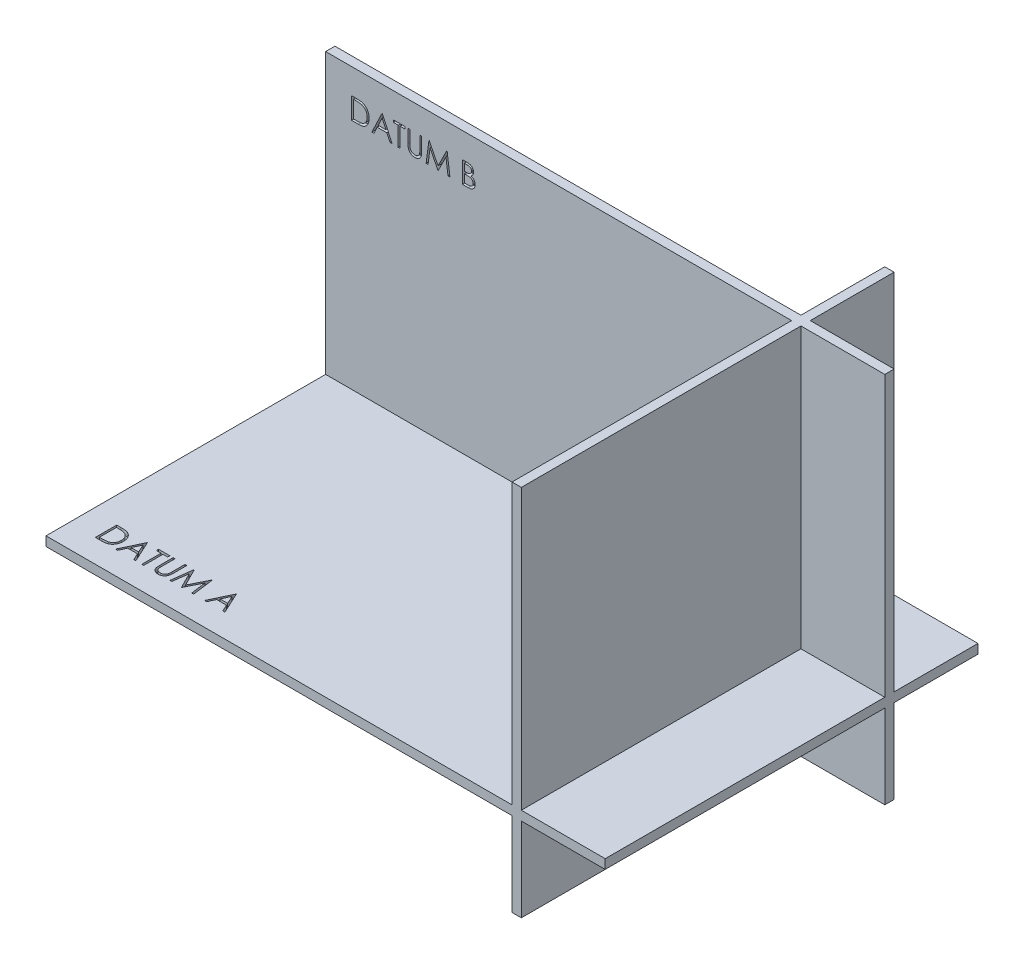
from build123d import *

# Parameters (mm, degrees)
SKETCH1_W           = 152.4
SKETCH1_H           = 101.6
FRONT_DATUM_B_DEPTH = 2.54
DATUM_B_TEXT_DEPTH  = 1.27
SKETCH2_W           = 152.4
SKETCH2_H           = 101.6
TOP_DATUM_A_DEPTH   = 2.54
DATUM_A_TEXT_DEPTH  = 1.27
SKETCH3_W           = 101.6
SKETCH3_H           = 101.6
RIGHT_DATUM_C_DEPTH = 2.54
DATUM_C_TEXT_DEPTH  = 1.27


with BuildPart() as part:
    # Sketch1 → Front Datum B (new body)
    with BuildSketch(Plane.XY):
        with Locations((-50.8, 25.4)):
            Rectangle(SKETCH1_W, SKETCH1_H)
    extrude(amount=-FRONT_DATUM_B_DEPTH)

    # Sketch4 → Datum B text (cut)
    # profile 1 of 6: a face of its own
    with BuildSketch(Plane.XY):
        with BuildLine():
            Line((-119.903739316, 63.5), (-119.903739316, 69.320833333))
            Line((-119.903739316, 69.320833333), (-118.728378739, 69.320833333))
            add(Edge.make_bspline(
                [(-118.728378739, 69.320833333), (-118.626149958, 69.320097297), (-118.428644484, 69.318675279), (-118.14323664, 69.30965899), (-117.87916412, 69.293709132), (-117.637295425, 69.270476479), (-117.416966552, 69.241949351), (-117.218794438, 69.206192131), (-117.041754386, 69.163969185), (-116.932872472, 69.12797074), (-116.881383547, 69.110947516)],
                knots=[0, 0, 0, 0, 1.314313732, 2.53924729, 3.670748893, 4.714932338, 5.66265055, 6.526160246, 7.303039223, 8, 8, 8, 8], degree=3))
            add(Edge.make_bspline(
                [(-116.881383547, 69.110947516), (-116.814036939, 69.085284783), (-116.68087092, 69.034541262), (-116.491266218, 68.938819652), (-116.312773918, 68.830364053), (-116.14443684, 68.709031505), (-115.990100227, 68.571386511), (-115.843734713, 68.423276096), (-115.711327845, 68.259314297), (-115.590074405, 68.08290149), (-115.480749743, 67.89611585), (-115.385721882, 67.699313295), (-115.306801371, 67.493493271), (-115.241286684, 67.27922815), (-115.189653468, 67.056046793), (-115.154425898, 66.823689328), (-115.131190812, 66.583074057), (-115.128855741, 66.419800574), (-115.12767094, 66.336956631)],
                knots=[0, 0, 0, 0, 0.984719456, 1.947108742, 2.898477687, 3.838006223, 4.779231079, 5.722358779, 6.681677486, 7.655904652, 8.64651281, 9.637519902, 10.640069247, 11.656948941, 12.698408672, 13.768548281, 14.867775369, 16, 16, 16, 16], degree=3))
            add(Edge.make_bspline(
                [(-115.12767094, 66.336956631), (-115.128716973, 66.265009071), (-115.13077829, 66.12322889), (-115.149287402, 65.914276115), (-115.176190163, 65.711522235), (-115.217841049, 65.515932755), (-115.268403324, 65.32579404), (-115.333204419, 65.143132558), (-115.4074375, 64.966272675), (-115.494001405, 64.797605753), (-115.589032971, 64.637809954), (-115.69101687, 64.487174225), (-115.799844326, 64.347848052), (-115.916553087, 64.219409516), (-116.039634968, 64.102052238), (-116.169895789, 63.994795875), (-116.307671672, 63.89973908), (-116.452345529, 63.813146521), (-116.608137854, 63.737608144), (-116.777999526, 63.673695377), (-116.96265495, 63.620731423), (-117.161650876, 63.576541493), (-117.375331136, 63.541487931), (-117.603905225, 63.517994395), (-117.847021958, 63.502106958), (-118.013962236, 63.500715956), (-118.09988732, 63.5)],
                knots=[0, 0, 0, 0, 1.105936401, 2.179363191, 3.223086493, 4.248585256, 5.251745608, 6.245858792, 7.225916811, 8.198733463, 9.158002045, 10.082870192, 10.993790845, 11.873723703, 12.748670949, 13.606408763, 14.465103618, 15.319838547, 16.196477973, 17.123216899, 18.106603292, 19.147568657, 20.255746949, 21.433717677, 22.679120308, 24, 24, 24, 24], degree=3))
            Line((-118.09988732, 63.5), (-119.903739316, 63.5))
        make_face()
        with BuildLine():
            Line((-119.381356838, 64.097008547), (-118.713220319, 64.097008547))
            add(Edge.make_bspline(
                [(-118.713220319, 64.097008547), (-118.617212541, 64.097421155), (-118.432554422, 64.098214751), (-118.167027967, 64.105178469), (-117.924416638, 64.116557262), (-117.704685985, 64.132481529), (-117.507960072, 64.153550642), (-117.333827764, 64.177041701), (-117.182859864, 64.206307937), (-117.091506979, 64.232835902), (-117.049292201, 64.245094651)],
                knots=[0, 0, 0, 0, 1.375205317, 2.645023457, 3.804390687, 4.853969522, 5.800190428, 6.637939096, 7.370582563, 8, 8, 8, 8], degree=3))
            add(Edge.make_bspline(
                [(-117.049292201, 64.245094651), (-116.996159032, 64.263807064), (-116.891161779, 64.300784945), (-116.740017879, 64.368236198), (-116.599058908, 64.448134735), (-116.465828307, 64.536947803), (-116.342216, 64.63780788), (-116.226757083, 64.748521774), (-116.119684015, 64.869652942), (-116.022103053, 65.001051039), (-115.934776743, 65.141898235), (-115.859153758, 65.290809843), (-115.792876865, 65.446154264), (-115.740857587, 65.610316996), (-115.700085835, 65.781830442), (-115.671206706, 65.960706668), (-115.653220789, 66.146912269), (-115.651122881, 66.273560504), (-115.650053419, 66.338122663)],
                knots=[0, 0, 0, 0, 0.998632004, 1.973411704, 2.929992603, 3.868527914, 4.809262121, 5.754881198, 6.702106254, 7.672490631, 8.653608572, 9.636854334, 10.631411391, 11.644891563, 12.686317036, 13.754757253, 14.855430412, 16, 16, 16, 16], degree=3))
            add(Edge.make_bspline(
                [(-115.650053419, 66.338122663), (-115.650907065, 66.406198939), (-115.652584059, 66.539935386), (-115.673662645, 66.73616515), (-115.704465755, 66.924894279), (-115.749009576, 67.106135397), (-115.805772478, 67.280242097), (-115.876611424, 67.446251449), (-115.957548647, 67.605916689), (-116.053847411, 67.755552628), (-116.159313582, 67.897070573), (-116.276358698, 68.026717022), (-116.403123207, 68.144787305), (-116.538224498, 68.253120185), (-116.685470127, 68.347357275), (-116.841391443, 68.431654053), (-117.008275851, 68.503193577), (-117.124381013, 68.541243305), (-117.183385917, 68.560580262)],
                knots=[0, 0, 0, 0, 1.122418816, 2.205001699, 3.251619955, 4.274784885, 5.280384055, 6.268708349, 7.249350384, 8.229342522, 9.199999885, 10.157847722, 11.105861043, 12.055065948, 13.010012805, 13.98527497, 14.976112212, 16, 16, 16, 16], degree=3))
            add(Edge.make_bspline(
                [(-117.183385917, 68.560580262), (-117.232199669, 68.574078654), (-117.335991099, 68.60277994), (-117.505359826, 68.634088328), (-117.695975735, 68.661703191), (-117.908685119, 68.685083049), (-118.143245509, 68.701859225), (-118.399837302, 68.714451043), (-118.678571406, 68.722943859), (-118.871794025, 68.723523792), (-118.972079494, 68.723824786)],
                knots=[0, 0, 0, 0, 0.674548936, 1.434276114, 2.292660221, 3.240891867, 4.284742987, 5.42552168, 6.663806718, 8, 8, 8, 8], degree=3))
            Line((-118.972079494, 68.723824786), (-119.381356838, 68.723824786))
            Line((-119.381356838, 68.723824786), (-119.381356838, 64.097008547))
        make_face(mode=Mode.SUBTRACT)
    # profile 2 of 6: a face of its own
    with BuildSketch(Plane.XY):
        Polygon((-111.545619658, 69.320833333), (-108.859081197, 63.5), (-109.426938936, 63.5), (-110.287470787, 65.365651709), (-112.926201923, 65.365651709), (-113.811220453, 63.5), (-114.381410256, 63.5), (-111.620245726, 69.320833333), align=None)
        Polygon((-111.588762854, 68.186283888), (-112.64285607, 65.962660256), (-110.562654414, 65.962660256), align=None, mode=Mode.SUBTRACT)
    # profile 3 of 6: a face of its own
    with BuildSketch(Plane.XY):
        Polygon((-108.485950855, 68.723824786), (-108.485950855, 69.320833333), (-105.426282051, 69.320833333), (-105.426282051, 68.723824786), (-106.694925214, 68.723824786), (-106.694925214, 63.5), (-107.217307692, 63.5), (-107.217307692, 68.723824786), align=None)
    # profile 4 of 6: a face of its own
    with BuildSketch(Plane.XY):
        with BuildLine():
            Line((-104.530769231, 69.320833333), (-104.008386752, 69.320833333))
            Line((-104.008386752, 69.320833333), (-104.008386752, 65.833230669))
            add(Edge.make_bspline(
                [(-104.008386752, 65.833230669), (-104.008464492, 65.783868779), (-104.008612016, 65.690196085), (-104.007626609, 65.556868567), (-104.004866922, 65.438335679), (-104.003127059, 65.334140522), (-103.999256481, 65.244761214), (-103.996099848, 65.169713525), (-103.99204097, 65.10935281), (-103.987162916, 65.074126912), (-103.985066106, 65.05898521)],
                knots=[0, 0, 0, 0, 1.528628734, 2.90083645, 4.128790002, 5.200304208, 6.127813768, 6.898992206, 7.526736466, 8, 8, 8, 8], degree=3))
            add(Edge.make_bspline(
                [(-103.985066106, 65.05898521), (-103.976455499, 65.004357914), (-103.959719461, 64.898181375), (-103.917067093, 64.746992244), (-103.857499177, 64.610732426), (-103.786912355, 64.485149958), (-103.693891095, 64.373740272), (-103.582457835, 64.271107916), (-103.447451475, 64.181347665), (-103.297339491, 64.099272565), (-103.135544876, 64.033305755), (-102.970214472, 63.983423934), (-102.80383347, 63.953024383), (-102.692445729, 63.949504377), (-102.637132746, 63.94775641)],
                knots=[0, 0, 0, 0, 1.035780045, 2.013197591, 2.933192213, 3.817615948, 4.702609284, 5.640816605, 6.646850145, 7.73207398, 8.84249596, 9.914020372, 10.964143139, 12, 12, 12, 12], degree=3))
            add(Edge.make_bspline(
                [(-102.637132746, 63.94775641), (-102.589645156, 63.949542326), (-102.494944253, 63.953103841), (-102.354235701, 63.975158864), (-102.217196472, 64.014907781), (-102.083149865, 64.066197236), (-101.957501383, 64.133964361), (-101.84018092, 64.21224765), (-101.735465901, 64.304068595), (-101.639907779, 64.405684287), (-101.556694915, 64.52033774), (-101.484564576, 64.645532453), (-101.425481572, 64.783152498), (-101.396305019, 64.87986884), (-101.381315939, 64.929555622)],
                knots=[0, 0, 0, 0, 0.994687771, 1.983630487, 2.973142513, 3.978332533, 4.983357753, 5.956394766, 6.925816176, 7.893390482, 8.871859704, 9.88551698, 10.913711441, 12, 12, 12, 12], degree=3))
            add(Edge.make_bspline(
                [(-101.381315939, 64.929555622), (-101.376326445, 64.950092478), (-101.365207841, 64.995856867), (-101.35481841, 65.073226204), (-101.343997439, 65.164512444), (-101.336489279, 65.270371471), (-101.32916963, 65.390448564), (-101.32479058, 65.525369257), (-101.322766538, 65.674643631), (-101.322163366, 65.778815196), (-101.321848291, 65.833230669)],
                knots=[0, 0, 0, 0, 0.558680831, 1.244966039, 2.062412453, 2.990489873, 4.051219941, 5.244515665, 6.560634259, 8, 8, 8, 8], degree=3))
            Line((-101.321848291, 65.833230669), (-101.321848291, 69.320833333))
            Line((-101.321848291, 69.320833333), (-100.799465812, 69.320833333))
            Line((-100.799465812, 69.320833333), (-100.799465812, 65.805245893))
            add(Edge.make_bspline(
                [(-100.799465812, 65.805245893), (-100.799888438, 65.741884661), (-100.800713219, 65.618231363), (-100.807865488, 65.437034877), (-100.819269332, 65.265149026), (-100.835381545, 65.102550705), (-100.856730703, 64.949821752), (-100.880471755, 64.805623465), (-100.91070605, 64.670990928), (-100.946019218, 64.544874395), (-100.98638844, 64.424823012), (-101.038678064, 64.310886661), (-101.097592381, 64.199601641), (-101.16746675, 64.092651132), (-101.245983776, 63.98956159), (-101.334879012, 63.890958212), (-101.431212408, 63.795265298), (-101.53658539, 63.704937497), (-101.649260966, 63.622100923), (-101.768903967, 63.549261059), (-101.894595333, 63.487687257), (-102.026008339, 63.437002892), (-102.163199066, 63.398893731), (-102.306170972, 63.370496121), (-102.455249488, 63.354360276), (-102.556639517, 63.351962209), (-102.607981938, 63.350747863)],
                knots=[0, 0, 0, 0, 1.316592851, 2.569410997, 3.76748051, 4.895814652, 5.963796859, 6.97159953, 7.931736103, 8.829262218, 9.692595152, 10.560224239, 11.431080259, 12.30701507, 13.211635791, 14.121146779, 15.063487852, 16.031507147, 17.00238618, 17.966455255, 18.938106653, 19.907068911, 20.888905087, 21.893141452, 22.933117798, 24, 24, 24, 24], degree=3))
            add(Edge.make_bspline(
                [(-102.607981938, 63.350747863), (-102.663976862, 63.352053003), (-102.773838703, 63.354613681), (-102.935721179, 63.369286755), (-103.090911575, 63.396924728), (-103.241048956, 63.432115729), (-103.384089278, 63.480651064), (-103.521948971, 63.537359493), (-103.65226692, 63.607005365), (-103.777157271, 63.684494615), (-103.89328249, 63.771681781), (-103.999882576, 63.866711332), (-104.097133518, 63.968060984), (-104.1833961, 64.076828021), (-104.260099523, 64.192166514), (-104.326174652, 64.31440275), (-104.382908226, 64.443489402), (-104.412189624, 64.533218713), (-104.426992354, 64.578579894)],
                knots=[0, 0, 0, 0, 1.13879206, 2.234305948, 3.301075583, 4.341971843, 5.366689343, 6.369221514, 7.369726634, 8.367512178, 9.355451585, 10.318319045, 11.268648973, 12.207971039, 13.137398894, 14.081662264, 15.030215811, 16, 16, 16, 16], degree=3))
            add(Edge.make_bspline(
                [(-104.426992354, 64.578579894), (-104.435602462, 64.60956764), (-104.454277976, 64.676780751), (-104.474277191, 64.788019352), (-104.491089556, 64.916102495), (-104.506898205, 65.061038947), (-104.516226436, 65.222941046), (-104.524404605, 65.401738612), (-104.530826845, 65.597647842), (-104.530788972, 65.734112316), (-104.530769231, 65.805245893)],
                knots=[0, 0, 0, 0, 0.625038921, 1.35572334, 2.194682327, 3.136881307, 4.189498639, 5.346923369, 6.617055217, 8, 8, 8, 8], degree=3))
            Line((-104.530769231, 65.805245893), (-104.530769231, 69.320833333))
        make_face()
    # profile 5 of 6: a face of its own
    with BuildSketch(Plane.XY):
        Polygon((-99.605448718, 63.5), (-98.83703342, 69.320833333), (-98.762407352, 69.320833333), (-96.359214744, 64.544764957), (-93.961852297, 69.320833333), (-93.886060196, 69.320833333), (-93.112980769, 63.5), (-93.637695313, 63.5), (-94.195058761, 67.688388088), (-96.296248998, 63.5), (-96.414018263, 63.5), (-98.523370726, 67.697716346), (-99.079568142, 63.5), align=None)
    # profile 6 of 6: a face of its own
    with BuildSketch(Plane.XY):
        with BuildLine():
            Line((-89.680181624, 69.320833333), (-88.544466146, 69.320833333))
            add(Edge.make_bspline(
                [(-88.544466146, 69.320833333), (-88.488871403, 69.320541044), (-88.381114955, 69.319974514), (-88.22441905, 69.311188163), (-88.077652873, 69.299207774), (-87.940773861, 69.280198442), (-87.813845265, 69.257261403), (-87.696484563, 69.229484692), (-87.589064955, 69.196178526), (-87.46081913, 69.143215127), (-87.314598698, 69.064512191), (-87.156274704, 68.948214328), (-87.020891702, 68.805965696), (-86.904165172, 68.645505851), (-86.811362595, 68.468991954), (-86.744224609, 68.280631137), (-86.701719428, 68.082852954), (-86.697348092, 67.947072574), (-86.695138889, 67.878451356)],
                knots=[0, 0, 0, 0, 1.001505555, 1.941167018, 2.826882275, 3.653841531, 4.429895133, 5.150066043, 5.825578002, 6.45369114, 7.647487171, 8.808567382, 9.977351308, 11.170798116, 12.373658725, 13.556498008, 14.765093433, 16, 16, 16, 16], degree=3))
            add(Edge.make_bspline(
                [(-86.695138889, 67.878451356), (-86.696957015, 67.814168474), (-86.700529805, 67.68784655), (-86.73469437, 67.503086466), (-86.788180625, 67.327212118), (-86.862529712, 67.160865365), (-86.959158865, 67.007804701), (-87.073676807, 66.866795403), (-87.211841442, 66.743807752), (-87.315357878, 66.675050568), (-87.367939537, 66.640125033)],
                knots=[0, 0, 0, 0, 1.044552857, 2.05264487, 3.044412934, 4.028983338, 5.005914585, 5.980388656, 6.974128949, 8, 8, 8, 8], degree=3))
            add(Edge.make_bspline(
                [(-87.367939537, 66.640125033), (-87.301814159, 66.614737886), (-87.175299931, 66.566165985), (-87.001197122, 66.480291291), (-86.851194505, 66.386888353), (-86.724138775, 66.284887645), (-86.615476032, 66.174942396), (-86.520591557, 66.055440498), (-86.439629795, 65.924823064), (-86.370257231, 65.784451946), (-86.316125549, 65.635760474), (-86.275586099, 65.480143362), (-86.252356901, 65.318158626), (-86.249051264, 65.207919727), (-86.247382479, 65.152267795)],
                knots=[0, 0, 0, 0, 1.27268992, 2.434971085, 3.483601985, 4.442670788, 5.356604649, 6.2567628, 7.179492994, 8.113709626, 9.066344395, 10.018646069, 10.999752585, 12, 12, 12, 12], degree=3))
            add(Edge.make_bspline(
                [(-86.247382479, 65.152267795), (-86.249007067, 65.095445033), (-86.252203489, 64.983644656), (-86.275786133, 64.819405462), (-86.315715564, 64.662450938), (-86.37071603, 64.51176589), (-86.44249907, 64.367641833), (-86.529858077, 64.229915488), (-86.634020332, 64.099970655), (-86.750541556, 63.976363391), (-86.882362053, 63.865222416), (-87.024582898, 63.766242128), (-87.17899517, 63.684840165), (-87.343062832, 63.616460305), (-87.518626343, 63.564227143), (-87.704897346, 63.52768466), (-87.901715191, 63.503062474), (-88.036774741, 63.501038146), (-88.106037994, 63.5)],
                knots=[0, 0, 0, 0, 0.978564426, 1.925352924, 2.850884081, 3.763762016, 4.682927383, 5.618979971, 6.567305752, 7.547517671, 8.540179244, 9.531824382, 10.526200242, 11.540722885, 12.589160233, 13.674978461, 14.80764778, 16, 16, 16, 16], degree=3))
            Line((-88.106037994, 63.5), (-89.680181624, 63.5))
            Line((-89.680181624, 63.5), (-89.680181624, 69.320833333))
        make_face()
        with BuildLine():
            Line((-89.157799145, 68.723824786), (-89.157799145, 66.858173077))
            Line((-89.157799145, 66.858173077), (-88.806823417, 66.858173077))
            add(Edge.make_bspline(
                [(-88.806823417, 66.858173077), (-88.755518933, 66.858838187), (-88.656388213, 66.860123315), (-88.512830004, 66.863804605), (-88.379574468, 66.874112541), (-88.256851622, 66.884417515), (-88.144854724, 66.901172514), (-88.043831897, 66.921116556), (-87.952197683, 66.942209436), (-87.846525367, 66.978081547), (-87.72666119, 67.031097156), (-87.59888042, 67.113373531), (-87.486231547, 67.211370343), (-87.391107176, 67.324445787), (-87.313255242, 67.448955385), (-87.259181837, 67.582912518), (-87.222515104, 67.722978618), (-87.219202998, 67.819135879), (-87.217521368, 67.867957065)],
                knots=[0, 0, 0, 0, 1.156816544, 2.235205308, 3.236616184, 4.169592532, 5.011045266, 5.787822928, 6.49130361, 7.128639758, 8.301311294, 9.436451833, 10.541879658, 11.654887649, 12.756523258, 13.837046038, 14.901820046, 16, 16, 16, 16], degree=3))
            add(Edge.make_bspline(
                [(-87.217521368, 67.867957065), (-87.218396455, 67.900263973), (-87.220113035, 67.963637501), (-87.234171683, 68.056021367), (-87.258066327, 68.142907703), (-87.288757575, 68.225487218), (-87.33164662, 68.301177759), (-87.382143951, 68.372596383), (-87.443155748, 68.437310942), (-87.512602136, 68.497796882), (-87.592445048, 68.551422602), (-87.682636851, 68.598389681), (-87.784397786, 68.636209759), (-87.896012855, 68.669332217), (-88.019200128, 68.692596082), (-88.152538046, 68.711976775), (-88.297118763, 68.72184349), (-88.397145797, 68.723149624), (-88.448851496, 68.723824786)],
                knots=[0, 0, 0, 0, 0.91205012, 1.789085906, 2.630437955, 3.453916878, 4.269457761, 5.079663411, 5.91843418, 6.774407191, 7.675494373, 8.627863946, 9.638891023, 10.736472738, 11.911756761, 13.175263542, 14.539845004, 16, 16, 16, 16], degree=3))
            Line((-88.448851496, 68.723824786), (-89.157799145, 68.723824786))
        make_face(mode=Mode.SUBTRACT)
        with BuildLine():
            Line((-89.157799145, 66.26116453), (-89.157799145, 64.097008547))
            Line((-89.157799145, 64.097008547), (-88.413870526, 64.097008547))
            add(Edge.make_bspline(
                [(-88.413870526, 64.097008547), (-88.360620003, 64.097646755), (-88.25798664, 64.098876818), (-88.109802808, 64.102892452), (-87.972459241, 64.11202663), (-87.846582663, 64.126405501), (-87.730813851, 64.142002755), (-87.6265416, 64.162976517), (-87.532920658, 64.187006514), (-87.424363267, 64.22415037), (-87.302119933, 64.281853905), (-87.170384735, 64.368857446), (-87.053259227, 64.472507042), (-86.953797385, 64.592467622), (-86.872284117, 64.722906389), (-86.812985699, 64.861185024), (-86.77641281, 65.005018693), (-86.771985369, 65.103085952), (-86.769764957, 65.152267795)],
                knots=[0, 0, 0, 0, 1.160039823, 2.235823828, 3.228722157, 4.157150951, 4.99529583, 5.772374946, 6.472645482, 7.099169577, 8.269452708, 9.405989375, 10.527446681, 11.663510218, 12.788923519, 13.866172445, 14.929861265, 16, 16, 16, 16], degree=3))
            add(Edge.make_bspline(
                [(-86.769764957, 65.152267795), (-86.770224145, 65.183023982), (-86.771135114, 65.244040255), (-86.784873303, 65.333707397), (-86.804853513, 65.420563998), (-86.830683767, 65.504845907), (-86.868302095, 65.585029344), (-86.912218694, 65.662700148), (-86.963710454, 65.737960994), (-87.043945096, 65.83311042), (-87.160647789, 65.942736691), (-87.326469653, 66.050068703), (-87.515018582, 66.136629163), (-87.651770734, 66.173382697), (-87.722413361, 66.192368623)],
                knots=[0, 0, 0, 0, 0.723448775, 1.435228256, 2.130040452, 2.821711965, 3.505591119, 4.210454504, 4.921174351, 5.648778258, 7.137944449, 8.670945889, 10.280296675, 12, 12, 12, 12], degree=3))
            add(Edge.make_bspline(
                [(-87.722413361, 66.192368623), (-87.75073437, 66.198114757), (-87.812140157, 66.21057356), (-87.912271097, 66.223724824), (-88.026585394, 66.235441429), (-88.155347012, 66.244108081), (-88.298718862, 66.253066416), (-88.457007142, 66.256550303), (-88.629565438, 66.26070681), (-88.74929561, 66.261008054), (-88.811487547, 66.26116453)],
                knots=[0, 0, 0, 0, 0.634451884, 1.375622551, 2.216452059, 3.157844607, 4.20941857, 5.370758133, 6.634282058, 8, 8, 8, 8], degree=3))
            Line((-88.811487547, 66.26116453), (-89.157799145, 66.26116453))
        make_face(mode=Mode.SUBTRACT)
    extrude(amount=-DATUM_B_TEXT_DEPTH, mode=Mode.SUBTRACT)

    # Sketch2 → Top Datum A (add)
    with BuildSketch(Plane(origin=(0, 0, 0), x_dir=(1, 0, 0), z_dir=(0, 1, 0))):
        with Locations((-50.8, -25.4)):
            Rectangle(SKETCH2_W, SKETCH2_H)
    extrude(amount=-TOP_DATUM_A_DEPTH)

    # Sketch6 → Datum A text (cut)
    # profile 1 of 6: a face of its own
    with BuildSketch(Plane(origin=(0, 0, 0), x_dir=(1, 0, 0), z_dir=(0, 1, 0))):
        with BuildLine():
            Line((-119.903739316, -69.85), (-119.903739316, -64.029166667))
            Line((-119.903739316, -64.029166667), (-118.728378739, -64.029166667))
            add(Edge.make_bspline(
                [(-118.728378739, -64.029166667), (-118.626149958, -64.029902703), (-118.428644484, -64.031324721), (-118.14323664, -64.04034101), (-117.87916412, -64.056290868), (-117.637295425, -64.079523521), (-117.416966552, -64.108050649), (-117.218794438, -64.143807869), (-117.041754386, -64.186030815), (-116.932872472, -64.22202926), (-116.881383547, -64.239052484)],
                knots=[0, 0, 0, 0, 1.314313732, 2.53924729, 3.670748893, 4.714932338, 5.66265055, 6.526160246, 7.303039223, 8, 8, 8, 8], degree=3))
            add(Edge.make_bspline(
                [(-116.881383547, -64.239052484), (-116.814036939, -64.264715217), (-116.68087092, -64.315458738), (-116.491266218, -64.411180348), (-116.312773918, -64.519635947), (-116.14443684, -64.640968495), (-115.990100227, -64.778613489), (-115.843734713, -64.926723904), (-115.711327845, -65.090685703), (-115.590074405, -65.26709851), (-115.480749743, -65.45388415), (-115.385721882, -65.650686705), (-115.306801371, -65.856506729), (-115.241286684, -66.07077185), (-115.189653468, -66.293953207), (-115.154425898, -66.526310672), (-115.131190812, -66.766925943), (-115.128855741, -66.930199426), (-115.12767094, -67.013043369)],
                knots=[0, 0, 0, 0, 0.984719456, 1.947108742, 2.898477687, 3.838006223, 4.779231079, 5.722358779, 6.681677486, 7.655904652, 8.64651281, 9.637519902, 10.640069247, 11.656948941, 12.698408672, 13.768548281, 14.867775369, 16, 16, 16, 16], degree=3))
            add(Edge.make_bspline(
                [(-115.12767094, -67.013043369), (-115.128716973, -67.084990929), (-115.13077829, -67.22677111), (-115.149287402, -67.435723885), (-115.176190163, -67.638477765), (-115.217841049, -67.834067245), (-115.268403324, -68.02420596), (-115.333204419, -68.206867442), (-115.4074375, -68.383727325), (-115.494001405, -68.552394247), (-115.589032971, -68.712190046), (-115.69101687, -68.862825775), (-115.799844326, -69.002151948), (-115.916553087, -69.130590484), (-116.039634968, -69.247947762), (-116.169895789, -69.355204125), (-116.307671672, -69.45026092), (-116.452345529, -69.536853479), (-116.608137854, -69.612391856), (-116.777999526, -69.676304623), (-116.96265495, -69.729268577), (-117.161650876, -69.773458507), (-117.375331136, -69.808512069), (-117.603905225, -69.832005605), (-117.847021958, -69.847893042), (-118.013962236, -69.849284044), (-118.09988732, -69.85)],
                knots=[0, 0, 0, 0, 1.105936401, 2.179363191, 3.223086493, 4.248585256, 5.251745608, 6.245858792, 7.225916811, 8.198733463, 9.158002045, 10.082870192, 10.993790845, 11.873723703, 12.748670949, 13.606408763, 14.465103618, 15.319838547, 16.196477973, 17.123216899, 18.106603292, 19.147568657, 20.255746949, 21.433717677, 22.679120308, 24, 24, 24, 24], degree=3))
            Line((-118.09988732, -69.85), (-119.903739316, -69.85))
        make_face()
        with BuildLine():
            Line((-119.381356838, -69.252991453), (-118.713220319, -69.252991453))
            add(Edge.make_bspline(
                [(-118.713220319, -69.252991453), (-118.617212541, -69.252578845), (-118.432554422, -69.251785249), (-118.167027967, -69.244821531), (-117.924416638, -69.233442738), (-117.704685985, -69.217518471), (-117.507960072, -69.196449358), (-117.333827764, -69.172958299), (-117.182859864, -69.143692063), (-117.091506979, -69.117164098), (-117.049292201, -69.104905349)],
                knots=[0, 0, 0, 0, 1.375205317, 2.645023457, 3.804390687, 4.853969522, 5.800190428, 6.637939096, 7.370582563, 8, 8, 8, 8], degree=3))
            add(Edge.make_bspline(
                [(-117.049292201, -69.104905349), (-116.996159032, -69.086192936), (-116.891161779, -69.049215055), (-116.740017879, -68.981763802), (-116.599058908, -68.901865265), (-116.465828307, -68.813052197), (-116.342216, -68.71219212), (-116.226757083, -68.601478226), (-116.119684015, -68.480347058), (-116.022103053, -68.348948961), (-115.934776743, -68.208101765), (-115.859153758, -68.059190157), (-115.792876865, -67.903845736), (-115.740857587, -67.739683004), (-115.700085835, -67.568169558), (-115.671206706, -67.389293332), (-115.653220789, -67.203087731), (-115.651122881, -67.076439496), (-115.650053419, -67.011877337)],
                knots=[0, 0, 0, 0, 0.998632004, 1.973411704, 2.929992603, 3.868527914, 4.809262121, 5.754881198, 6.702106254, 7.672490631, 8.653608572, 9.636854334, 10.631411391, 11.644891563, 12.686317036, 13.754757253, 14.855430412, 16, 16, 16, 16], degree=3))
            add(Edge.make_bspline(
                [(-115.650053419, -67.011877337), (-115.650907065, -66.943801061), (-115.652584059, -66.810064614), (-115.673662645, -66.61383485), (-115.704465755, -66.425105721), (-115.749009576, -66.243864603), (-115.805772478, -66.069757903), (-115.876611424, -65.903748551), (-115.957548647, -65.744083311), (-116.053847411, -65.594447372), (-116.159313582, -65.452929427), (-116.276358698, -65.323282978), (-116.403123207, -65.205212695), (-116.538224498, -65.096879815), (-116.685470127, -65.002642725), (-116.841391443, -64.918345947), (-117.008275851, -64.846806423), (-117.124381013, -64.808756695), (-117.183385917, -64.789419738)],
                knots=[0, 0, 0, 0, 1.122418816, 2.205001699, 3.251619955, 4.274784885, 5.280384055, 6.268708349, 7.249350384, 8.229342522, 9.199999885, 10.157847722, 11.105861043, 12.055065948, 13.010012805, 13.98527497, 14.976112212, 16, 16, 16, 16], degree=3))
            add(Edge.make_bspline(
                [(-117.183385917, -64.789419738), (-117.232199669, -64.775921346), (-117.335991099, -64.74722006), (-117.505359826, -64.715911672), (-117.695975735, -64.688296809), (-117.908685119, -64.664916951), (-118.143245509, -64.648140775), (-118.399837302, -64.635548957), (-118.678571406, -64.627056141), (-118.871794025, -64.626476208), (-118.972079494, -64.626175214)],
                knots=[0, 0, 0, 0, 0.674548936, 1.434276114, 2.292660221, 3.240891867, 4.284742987, 5.42552168, 6.663806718, 8, 8, 8, 8], degree=3))
            Line((-118.972079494, -64.626175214), (-119.381356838, -64.626175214))
            Line((-119.381356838, -64.626175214), (-119.381356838, -69.252991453))
        make_face(mode=Mode.SUBTRACT)
    # profile 2 of 6: a face of its own
    with BuildSketch(Plane(origin=(0, 0, 0), x_dir=(1, 0, 0), z_dir=(0, 1, 0))):
        Polygon((-111.545619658, -64.029166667), (-108.859081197, -69.85), (-109.426938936, -69.85), (-110.287470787, -67.984348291), (-112.926201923, -67.984348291), (-113.811220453, -69.85), (-114.381410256, -69.85), (-111.620245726, -64.029166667), align=None)
        Polygon((-111.588762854, -65.163716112), (-112.64285607, -67.387339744), (-110.562654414, -67.387339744), align=None, mode=Mode.SUBTRACT)
    # profile 3 of 6: a face of its own
    with BuildSketch(Plane(origin=(0, 0, 0), x_dir=(1, 0, 0), z_dir=(0, 1, 0))):
        Polygon((-108.485950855, -64.626175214), (-108.485950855, -64.029166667), (-105.426282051, -64.029166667), (-105.426282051, -64.626175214), (-106.694925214, -64.626175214), (-106.694925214, -69.85), (-107.217307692, -69.85), (-107.217307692, -64.626175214), align=None)
    # profile 4 of 6: a face of its own
    with BuildSketch(Plane(origin=(0, 0, 0), x_dir=(1, 0, 0), z_dir=(0, 1, 0))):
        with BuildLine():
            Line((-104.530769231, -64.029166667), (-104.008386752, -64.029166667))
            Line((-104.008386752, -64.029166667), (-104.008386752, -67.516769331))
            add(Edge.make_bspline(
                [(-104.008386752, -67.516769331), (-104.008464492, -67.566131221), (-104.008612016, -67.659803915), (-104.007626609, -67.793131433), (-104.004866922, -67.911664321), (-104.003127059, -68.015859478), (-103.999256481, -68.105238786), (-103.996099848, -68.180286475), (-103.99204097, -68.24064719), (-103.987162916, -68.275873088), (-103.985066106, -68.29101479)],
                knots=[0, 0, 0, 0, 1.528628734, 2.90083645, 4.128790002, 5.200304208, 6.127813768, 6.898992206, 7.526736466, 8, 8, 8, 8], degree=3))
            add(Edge.make_bspline(
                [(-103.985066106, -68.29101479), (-103.976455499, -68.345642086), (-103.959719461, -68.451818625), (-103.917067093, -68.603007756), (-103.857499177, -68.739267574), (-103.786912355, -68.864850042), (-103.693891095, -68.976259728), (-103.582457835, -69.078892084), (-103.447451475, -69.168652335), (-103.297339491, -69.250727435), (-103.135544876, -69.316694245), (-102.970214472, -69.366576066), (-102.80383347, -69.396975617), (-102.692445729, -69.400495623), (-102.637132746, -69.40224359)],
                knots=[0, 0, 0, 0, 1.035780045, 2.013197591, 2.933192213, 3.817615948, 4.702609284, 5.640816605, 6.646850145, 7.73207398, 8.84249596, 9.914020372, 10.964143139, 12, 12, 12, 12], degree=3))
            add(Edge.make_bspline(
                [(-102.637132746, -69.40224359), (-102.589645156, -69.400457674), (-102.494944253, -69.396896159), (-102.354235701, -69.374841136), (-102.217196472, -69.335092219), (-102.083149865, -69.283802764), (-101.957501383, -69.216035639), (-101.84018092, -69.13775235), (-101.735465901, -69.045931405), (-101.639907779, -68.944315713), (-101.556694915, -68.82966226), (-101.484564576, -68.704467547), (-101.425481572, -68.566847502), (-101.396305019, -68.47013116), (-101.381315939, -68.420444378)],
                knots=[0, 0, 0, 0, 0.994687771, 1.983630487, 2.973142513, 3.978332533, 4.983357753, 5.956394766, 6.925816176, 7.893390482, 8.871859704, 9.88551698, 10.913711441, 12, 12, 12, 12], degree=3))
            add(Edge.make_bspline(
                [(-101.381315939, -68.420444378), (-101.376326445, -68.399907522), (-101.365207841, -68.354143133), (-101.35481841, -68.276773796), (-101.343997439, -68.185487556), (-101.336489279, -68.079628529), (-101.32916963, -67.959551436), (-101.32479058, -67.824630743), (-101.322766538, -67.675356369), (-101.322163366, -67.571184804), (-101.321848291, -67.516769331)],
                knots=[0, 0, 0, 0, 0.558680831, 1.244966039, 2.062412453, 2.990489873, 4.051219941, 5.244515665, 6.560634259, 8, 8, 8, 8], degree=3))
            Line((-101.321848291, -67.516769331), (-101.321848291, -64.029166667))
            Line((-101.321848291, -64.029166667), (-100.799465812, -64.029166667))
            Line((-100.799465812, -64.029166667), (-100.799465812, -67.544754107))
            add(Edge.make_bspline(
                [(-100.799465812, -67.544754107), (-100.799888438, -67.608115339), (-100.800713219, -67.731768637), (-100.807865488, -67.912965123), (-100.819269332, -68.084850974), (-100.835381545, -68.247449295), (-100.856730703, -68.400178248), (-100.880471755, -68.544376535), (-100.91070605, -68.679009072), (-100.946019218, -68.805125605), (-100.98638844, -68.925176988), (-101.038678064, -69.039113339), (-101.097592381, -69.150398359), (-101.16746675, -69.257348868), (-101.245983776, -69.36043841), (-101.334879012, -69.459041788), (-101.431212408, -69.554734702), (-101.53658539, -69.645062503), (-101.649260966, -69.727899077), (-101.768903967, -69.800738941), (-101.894595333, -69.862312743), (-102.026008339, -69.912997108), (-102.163199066, -69.951106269), (-102.306170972, -69.979503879), (-102.455249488, -69.995639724), (-102.556639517, -69.998037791), (-102.607981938, -69.999252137)],
                knots=[0, 0, 0, 0, 1.316592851, 2.569410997, 3.76748051, 4.895814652, 5.963796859, 6.97159953, 7.931736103, 8.829262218, 9.692595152, 10.560224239, 11.431080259, 12.30701507, 13.211635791, 14.121146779, 15.063487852, 16.031507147, 17.00238618, 17.966455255, 18.938106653, 19.907068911, 20.888905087, 21.893141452, 22.933117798, 24, 24, 24, 24], degree=3))
            add(Edge.make_bspline(
                [(-102.607981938, -69.999252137), (-102.663976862, -69.997946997), (-102.773838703, -69.995386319), (-102.935721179, -69.980713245), (-103.090911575, -69.953075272), (-103.241048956, -69.917884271), (-103.384089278, -69.869348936), (-103.521948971, -69.812640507), (-103.65226692, -69.742994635), (-103.777157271, -69.665505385), (-103.89328249, -69.578318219), (-103.999882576, -69.483288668), (-104.097133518, -69.381939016), (-104.1833961, -69.273171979), (-104.260099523, -69.157833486), (-104.326174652, -69.03559725), (-104.382908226, -68.906510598), (-104.412189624, -68.816781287), (-104.426992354, -68.771420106)],
                knots=[0, 0, 0, 0, 1.13879206, 2.234305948, 3.301075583, 4.341971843, 5.366689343, 6.369221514, 7.369726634, 8.367512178, 9.355451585, 10.318319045, 11.268648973, 12.207971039, 13.137398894, 14.081662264, 15.030215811, 16, 16, 16, 16], degree=3))
            add(Edge.make_bspline(
                [(-104.426992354, -68.771420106), (-104.435602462, -68.74043236), (-104.454277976, -68.673219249), (-104.474277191, -68.561980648), (-104.491089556, -68.433897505), (-104.506898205, -68.288961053), (-104.516226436, -68.127058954), (-104.524404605, -67.948261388), (-104.530826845, -67.752352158), (-104.530788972, -67.615887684), (-104.530769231, -67.544754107)],
                knots=[0, 0, 0, 0, 0.625038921, 1.35572334, 2.194682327, 3.136881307, 4.189498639, 5.346923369, 6.617055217, 8, 8, 8, 8], degree=3))
            Line((-104.530769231, -67.544754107), (-104.530769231, -64.029166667))
        make_face()
    # profile 5 of 6: a face of its own
    with BuildSketch(Plane(origin=(0, 0, 0), x_dir=(1, 0, 0), z_dir=(0, 1, 0))):
        Polygon((-99.605448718, -69.85), (-98.83703342, -64.029166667), (-98.762407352, -64.029166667), (-96.359214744, -68.805235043), (-93.961852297, -64.029166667), (-93.886060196, -64.029166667), (-93.112980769, -69.85), (-93.637695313, -69.85), (-94.195058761, -65.661611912), (-96.296248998, -69.85), (-96.414018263, -69.85), (-98.523370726, -65.652283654), (-99.079568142, -69.85), align=None)
    # profile 6 of 6: a face of its own
    with BuildSketch(Plane(origin=(0, 0, 0), x_dir=(1, 0, 0), z_dir=(0, 1, 0))):
        Polygon((-87.292147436, -64.029166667), (-84.605608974, -69.85), (-85.173466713, -69.85), (-86.033998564, -67.984348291), (-88.672729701, -67.984348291), (-89.557748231, -69.85), (-90.127938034, -69.85), (-87.366773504, -64.029166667), align=None)
        Polygon((-87.335290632, -65.163716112), (-88.389383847, -67.387339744), (-86.309182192, -67.387339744), align=None, mode=Mode.SUBTRACT)
    extrude(amount=-DATUM_A_TEXT_DEPTH, mode=Mode.SUBTRACT)

    # Sketch3 → Right Datum C (add)
    with BuildSketch(Plane(origin=(0, 0, 0), x_dir=(0, 0, -1), z_dir=(1, 0, 0))):
        with Locations((-25.4, 25.4)):
            Rectangle(SKETCH3_W, SKETCH3_H)
    extrude(amount=RIGHT_DATUM_C_DEPTH)

    # Sketch7 → Datum C text (cut)
    # profile 1 of 6: a face of its own
    with BuildSketch(Plane.ZY):
        with BuildLine():
            Line((32.496260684, 63.5), (32.496260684, 69.320833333))
            Line((32.496260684, 69.320833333), (33.671621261, 69.320833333))
            add(Edge.make_bspline(
                [(33.671621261, 69.320833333), (33.773850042, 69.320097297), (33.971355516, 69.318675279), (34.25676336, 69.30965899), (34.52083588, 69.293709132), (34.762704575, 69.270476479), (34.983033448, 69.241949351), (35.181205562, 69.206192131), (35.358245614, 69.163969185), (35.467127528, 69.12797074), (35.518616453, 69.110947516)],
                knots=[0, 0, 0, 0, 1.314313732, 2.53924729, 3.670748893, 4.714932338, 5.66265055, 6.526160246, 7.303039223, 8, 8, 8, 8], degree=3))
            add(Edge.make_bspline(
                [(35.518616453, 69.110947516), (35.585963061, 69.085284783), (35.71912908, 69.034541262), (35.908733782, 68.938819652), (36.087226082, 68.830364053), (36.25556316, 68.709031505), (36.409899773, 68.571386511), (36.556265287, 68.423276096), (36.688672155, 68.259314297), (36.809925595, 68.08290149), (36.919250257, 67.89611585), (37.014278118, 67.699313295), (37.093198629, 67.493493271), (37.158713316, 67.27922815), (37.210346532, 67.056046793), (37.245574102, 66.823689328), (37.268809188, 66.583074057), (37.271144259, 66.419800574), (37.27232906, 66.336956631)],
                knots=[0, 0, 0, 0, 0.984719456, 1.947108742, 2.898477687, 3.838006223, 4.779231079, 5.722358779, 6.681677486, 7.655904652, 8.64651281, 9.637519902, 10.640069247, 11.656948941, 12.698408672, 13.768548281, 14.867775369, 16, 16, 16, 16], degree=3))
            add(Edge.make_bspline(
                [(37.27232906, 66.336956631), (37.271283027, 66.265009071), (37.26922171, 66.12322889), (37.250712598, 65.914276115), (37.223809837, 65.711522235), (37.182158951, 65.515932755), (37.131596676, 65.32579404), (37.066795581, 65.143132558), (36.9925625, 64.966272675), (36.905998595, 64.797605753), (36.810967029, 64.637809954), (36.70898313, 64.487174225), (36.600155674, 64.347848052), (36.483446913, 64.219409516), (36.360365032, 64.102052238), (36.230104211, 63.994795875), (36.092328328, 63.89973908), (35.947654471, 63.813146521), (35.791862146, 63.737608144), (35.622000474, 63.673695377), (35.43734505, 63.620731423), (35.238349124, 63.576541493), (35.024668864, 63.541487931), (34.796094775, 63.517994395), (34.552978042, 63.502106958), (34.386037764, 63.500715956), (34.30011268, 63.5)],
                knots=[0, 0, 0, 0, 1.105936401, 2.179363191, 3.223086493, 4.248585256, 5.251745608, 6.245858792, 7.225916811, 8.198733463, 9.158002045, 10.082870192, 10.993790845, 11.873723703, 12.748670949, 13.606408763, 14.465103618, 15.319838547, 16.196477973, 17.123216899, 18.106603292, 19.147568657, 20.255746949, 21.433717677, 22.679120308, 24, 24, 24, 24], degree=3))
            Line((34.30011268, 63.5), (32.496260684, 63.5))
        make_face()
        with BuildLine():
            Line((33.018643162, 64.097008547), (33.686779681, 64.097008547))
            add(Edge.make_bspline(
                [(33.686779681, 64.097008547), (33.782787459, 64.097421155), (33.967445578, 64.098214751), (34.232972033, 64.105178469), (34.475583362, 64.116557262), (34.695314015, 64.132481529), (34.892039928, 64.153550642), (35.066172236, 64.177041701), (35.217140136, 64.206307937), (35.308493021, 64.232835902), (35.350707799, 64.245094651)],
                knots=[0, 0, 0, 0, 1.375205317, 2.645023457, 3.804390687, 4.853969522, 5.800190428, 6.637939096, 7.370582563, 8, 8, 8, 8], degree=3))
            add(Edge.make_bspline(
                [(35.350707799, 64.245094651), (35.403840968, 64.263807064), (35.508838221, 64.300784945), (35.659982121, 64.368236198), (35.800941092, 64.448134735), (35.934171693, 64.536947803), (36.057784, 64.63780788), (36.173242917, 64.748521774), (36.280315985, 64.869652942), (36.377896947, 65.001051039), (36.465223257, 65.141898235), (36.540846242, 65.290809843), (36.607123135, 65.446154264), (36.659142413, 65.610316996), (36.699914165, 65.781830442), (36.728793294, 65.960706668), (36.746779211, 66.146912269), (36.748877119, 66.273560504), (36.749946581, 66.338122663)],
                knots=[0, 0, 0, 0, 0.998632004, 1.973411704, 2.929992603, 3.868527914, 4.809262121, 5.754881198, 6.702106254, 7.672490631, 8.653608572, 9.636854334, 10.631411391, 11.644891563, 12.686317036, 13.754757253, 14.855430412, 16, 16, 16, 16], degree=3))
            add(Edge.make_bspline(
                [(36.749946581, 66.338122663), (36.749092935, 66.406198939), (36.747415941, 66.539935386), (36.726337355, 66.73616515), (36.695534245, 66.924894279), (36.650990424, 67.106135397), (36.594227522, 67.280242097), (36.523388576, 67.446251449), (36.442451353, 67.605916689), (36.346152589, 67.755552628), (36.240686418, 67.897070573), (36.123641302, 68.026717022), (35.996876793, 68.144787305), (35.861775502, 68.253120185), (35.714529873, 68.347357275), (35.558608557, 68.431654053), (35.391724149, 68.503193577), (35.275618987, 68.541243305), (35.216614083, 68.560580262)],
                knots=[0, 0, 0, 0, 1.122418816, 2.205001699, 3.251619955, 4.274784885, 5.280384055, 6.268708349, 7.249350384, 8.229342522, 9.199999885, 10.157847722, 11.105861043, 12.055065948, 13.010012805, 13.98527497, 14.976112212, 16, 16, 16, 16], degree=3))
            add(Edge.make_bspline(
                [(35.216614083, 68.560580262), (35.167800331, 68.574078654), (35.064008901, 68.60277994), (34.894640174, 68.634088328), (34.704024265, 68.661703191), (34.491314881, 68.685083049), (34.256754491, 68.701859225), (34.000162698, 68.714451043), (33.721428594, 68.722943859), (33.528205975, 68.723523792), (33.427920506, 68.723824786)],
                knots=[0, 0, 0, 0, 0.674548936, 1.434276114, 2.292660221, 3.240891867, 4.284742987, 5.42552168, 6.663806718, 8, 8, 8, 8], degree=3))
            Line((33.427920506, 68.723824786), (33.018643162, 68.723824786))
            Line((33.018643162, 68.723824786), (33.018643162, 64.097008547))
        make_face(mode=Mode.SUBTRACT)
    # profile 2 of 6: a face of its own
    with BuildSketch(Plane.ZY):
        Polygon((40.854380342, 69.320833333), (43.540918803, 63.5), (42.973061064, 63.5), (42.112529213, 65.365651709), (39.473798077, 65.365651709), (38.588779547, 63.5), (38.018589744, 63.5), (40.779754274, 69.320833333), align=None)
        Polygon((40.811237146, 68.186283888), (39.75714393, 65.962660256), (41.837345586, 65.962660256), align=None, mode=Mode.SUBTRACT)
    # profile 3 of 6: a face of its own
    with BuildSketch(Plane.ZY):
        Polygon((43.914049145, 68.723824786), (43.914049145, 69.320833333), (46.973717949, 69.320833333), (46.973717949, 68.723824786), (45.705074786, 68.723824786), (45.705074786, 63.5), (45.182692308, 63.5), (45.182692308, 68.723824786), align=None)
    # profile 4 of 6: a face of its own
    with BuildSketch(Plane.ZY):
        with BuildLine():
            Line((47.869230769, 69.320833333), (48.391613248, 69.320833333))
            Line((48.391613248, 69.320833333), (48.391613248, 65.833230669))
            add(Edge.make_bspline(
                [(48.391613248, 65.833230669), (48.391535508, 65.783868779), (48.391387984, 65.690196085), (48.392373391, 65.556868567), (48.395133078, 65.438335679), (48.396872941, 65.334140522), (48.400743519, 65.244761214), (48.403900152, 65.169713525), (48.40795903, 65.10935281), (48.412837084, 65.074126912), (48.414933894, 65.05898521)],
                knots=[0, 0, 0, 0, 1.528628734, 2.90083645, 4.128790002, 5.200304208, 6.127813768, 6.898992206, 7.526736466, 8, 8, 8, 8], degree=3))
            add(Edge.make_bspline(
                [(48.414933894, 65.05898521), (48.423544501, 65.004357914), (48.440280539, 64.898181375), (48.482932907, 64.746992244), (48.542500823, 64.610732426), (48.613087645, 64.485149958), (48.706108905, 64.373740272), (48.817542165, 64.271107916), (48.952548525, 64.181347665), (49.102660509, 64.099272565), (49.264455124, 64.033305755), (49.429785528, 63.983423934), (49.59616653, 63.953024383), (49.707554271, 63.949504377), (49.762867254, 63.94775641)],
                knots=[0, 0, 0, 0, 1.035780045, 2.013197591, 2.933192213, 3.817615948, 4.702609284, 5.640816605, 6.646850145, 7.73207398, 8.84249596, 9.914020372, 10.964143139, 12, 12, 12, 12], degree=3))
            add(Edge.make_bspline(
                [(49.762867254, 63.94775641), (49.810354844, 63.949542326), (49.905055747, 63.953103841), (50.045764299, 63.975158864), (50.182803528, 64.014907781), (50.316850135, 64.066197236), (50.442498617, 64.133964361), (50.55981908, 64.21224765), (50.664534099, 64.304068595), (50.760092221, 64.405684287), (50.843305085, 64.52033774), (50.915435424, 64.645532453), (50.974518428, 64.783152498), (51.003694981, 64.87986884), (51.018684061, 64.929555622)],
                knots=[0, 0, 0, 0, 0.994687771, 1.983630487, 2.973142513, 3.978332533, 4.983357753, 5.956394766, 6.925816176, 7.893390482, 8.871859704, 9.88551698, 10.913711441, 12, 12, 12, 12], degree=3))
            add(Edge.make_bspline(
                [(51.018684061, 64.929555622), (51.023673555, 64.950092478), (51.034792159, 64.995856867), (51.04518159, 65.073226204), (51.056002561, 65.164512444), (51.063510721, 65.270371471), (51.07083037, 65.390448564), (51.07520942, 65.525369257), (51.077233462, 65.674643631), (51.077836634, 65.778815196), (51.078151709, 65.833230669)],
                knots=[0, 0, 0, 0, 0.558680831, 1.244966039, 2.062412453, 2.990489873, 4.051219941, 5.244515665, 6.560634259, 8, 8, 8, 8], degree=3))
            Line((51.078151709, 65.833230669), (51.078151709, 69.320833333))
            Line((51.078151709, 69.320833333), (51.600534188, 69.320833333))
            Line((51.600534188, 69.320833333), (51.600534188, 65.805245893))
            add(Edge.make_bspline(
                [(51.600534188, 65.805245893), (51.600111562, 65.741884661), (51.599286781, 65.618231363), (51.592134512, 65.437034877), (51.580730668, 65.265149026), (51.564618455, 65.102550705), (51.543269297, 64.949821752), (51.519528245, 64.805623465), (51.48929395, 64.670990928), (51.453980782, 64.544874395), (51.41361156, 64.424823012), (51.361321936, 64.310886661), (51.302407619, 64.199601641), (51.23253325, 64.092651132), (51.154016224, 63.98956159), (51.065120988, 63.890958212), (50.968787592, 63.795265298), (50.86341461, 63.704937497), (50.750739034, 63.622100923), (50.631096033, 63.549261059), (50.505404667, 63.487687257), (50.373991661, 63.437002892), (50.236800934, 63.398893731), (50.093829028, 63.370496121), (49.944750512, 63.354360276), (49.843360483, 63.351962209), (49.792018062, 63.350747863)],
                knots=[0, 0, 0, 0, 1.316592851, 2.569410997, 3.76748051, 4.895814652, 5.963796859, 6.97159953, 7.931736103, 8.829262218, 9.692595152, 10.560224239, 11.431080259, 12.30701507, 13.211635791, 14.121146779, 15.063487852, 16.031507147, 17.00238618, 17.966455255, 18.938106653, 19.907068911, 20.888905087, 21.893141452, 22.933117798, 24, 24, 24, 24], degree=3))
            add(Edge.make_bspline(
                [(49.792018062, 63.350747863), (49.736023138, 63.352053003), (49.626161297, 63.354613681), (49.464278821, 63.369286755), (49.309088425, 63.396924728), (49.158951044, 63.432115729), (49.015910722, 63.480651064), (48.878051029, 63.537359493), (48.74773308, 63.607005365), (48.622842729, 63.684494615), (48.50671751, 63.771681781), (48.400117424, 63.866711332), (48.302866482, 63.968060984), (48.2166039, 64.076828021), (48.139900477, 64.192166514), (48.073825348, 64.31440275), (48.017091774, 64.443489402), (47.987810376, 64.533218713), (47.973007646, 64.578579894)],
                knots=[0, 0, 0, 0, 1.13879206, 2.234305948, 3.301075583, 4.341971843, 5.366689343, 6.369221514, 7.369726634, 8.367512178, 9.355451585, 10.318319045, 11.268648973, 12.207971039, 13.137398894, 14.081662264, 15.030215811, 16, 16, 16, 16], degree=3))
            add(Edge.make_bspline(
                [(47.973007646, 64.578579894), (47.964397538, 64.60956764), (47.945722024, 64.676780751), (47.925722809, 64.788019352), (47.908910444, 64.916102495), (47.893101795, 65.061038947), (47.883773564, 65.222941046), (47.875595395, 65.401738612), (47.869173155, 65.597647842), (47.869211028, 65.734112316), (47.869230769, 65.805245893)],
                knots=[0, 0, 0, 0, 0.625038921, 1.35572334, 2.194682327, 3.136881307, 4.189498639, 5.346923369, 6.617055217, 8, 8, 8, 8], degree=3))
            Line((47.869230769, 65.805245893), (47.869230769, 69.320833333))
        make_face()
    # profile 5 of 6: a face of its own
    with BuildSketch(Plane.ZY):
        Polygon((52.794551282, 63.5), (53.56296658, 69.320833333), (53.637592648, 69.320833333), (56.040785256, 64.544764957), (58.438147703, 69.320833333), (58.513939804, 69.320833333), (59.287019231, 63.5), (58.762304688, 63.5), (58.204941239, 67.688388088), (56.103751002, 63.5), (55.985981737, 63.5), (53.876629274, 67.697716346), (53.320431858, 63.5), align=None)
    # profile 6 of 6: a face of its own
    with BuildSketch(Plane.ZY):
        with BuildLine():
            Line((68.092895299, 68.25274773), (67.63581063, 67.902938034))
            add(Edge.make_bspline(
                [(67.63581063, 67.902938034), (67.603204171, 67.941797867), (67.538430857, 68.018993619), (67.434222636, 68.127393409), (67.325619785, 68.228950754), (67.212663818, 68.324149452), (67.093321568, 68.40966043), (66.970484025, 68.489939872), (66.842096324, 68.56189824), (66.664558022, 68.649149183), (66.432310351, 68.740197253), (66.139946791, 68.816538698), (65.834750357, 68.865136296), (65.626534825, 68.870399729), (65.520628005, 68.873076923)],
                knots=[0, 0, 0, 0, 0.757959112, 1.505699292, 2.245454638, 2.979532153, 3.711538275, 4.438200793, 5.171680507, 5.909471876, 7.393775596, 8.890124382, 10.418191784, 12, 12, 12, 12], degree=3))
            add(Edge.make_bspline(
                [(65.520628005, 68.873076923), (65.462281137, 68.872405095), (65.346128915, 68.871067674), (65.173751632, 68.853423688), (65.004593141, 68.828624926), (64.838763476, 68.791828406), (64.676473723, 68.745307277), (64.516662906, 68.68971763), (64.361644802, 68.620940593), (64.209274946, 68.544923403), (64.063289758, 68.459062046), (63.925161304, 68.365407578), (63.795393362, 68.265008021), (63.673883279, 68.157487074), (63.560506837, 68.043328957), (63.456085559, 67.92131707), (63.360980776, 67.791841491), (63.273307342, 67.65660955), (63.19478807, 67.516015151), (63.129046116, 67.369537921), (63.070829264, 67.219686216), (63.024762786, 67.064766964), (62.988300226, 66.905870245), (62.963141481, 66.742569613), (62.945698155, 66.57520622), (62.944367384, 66.461767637), (62.943696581, 66.404586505)],
                knots=[0, 0, 0, 0, 1.054917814, 2.100044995, 3.131103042, 4.146048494, 5.169673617, 6.183595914, 7.203665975, 8.234915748, 9.262203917, 10.264457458, 11.251630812, 12.227803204, 13.197192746, 14.159520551, 15.12972552, 16.100847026, 17.073214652, 18.039054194, 19.002613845, 19.979014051, 20.95965708, 21.949030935, 22.966165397, 24, 24, 24, 24], degree=3))
            add(Edge.make_bspline(
                [(62.943696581, 66.404586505), (62.945795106, 66.318552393), (62.949915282, 66.149635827), (62.986583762, 65.902216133), (63.042305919, 65.665190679), (63.125819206, 65.440041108), (63.228796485, 65.223991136), (63.358918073, 65.020696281), (63.509622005, 64.827084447), (63.683040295, 64.647731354), (63.873308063, 64.483893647), (64.07744953, 64.339619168), (64.294956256, 64.219352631), (64.523426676, 64.119274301), (64.764618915, 64.042344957), (65.018099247, 63.988187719), (65.283316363, 63.952859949), (65.464542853, 63.949477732), (65.556775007, 63.94775641)],
                knots=[0, 0, 0, 0, 1.029171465, 2.020641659, 2.987623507, 3.938342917, 4.889210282, 5.84687017, 6.821220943, 7.821438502, 8.827599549, 9.822697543, 10.807740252, 11.797342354, 12.80366471, 13.83203677, 14.896651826, 16, 16, 16, 16], degree=3))
            add(Edge.make_bspline(
                [(65.556775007, 63.94775641), (65.658394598, 63.950565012), (65.858406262, 63.956093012), (66.151723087, 64.002924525), (66.432513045, 64.07885799), (66.70079124, 64.185126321), (66.95580136, 64.323271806), (67.197942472, 64.490741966), (67.427418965, 64.689129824), (67.565408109, 64.840609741), (67.63581063, 64.917895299)],
                knots=[0, 0, 0, 0, 1.028121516, 2.023589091, 2.998037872, 3.967518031, 4.937445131, 5.927275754, 6.942489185, 8, 8, 8, 8], degree=3))
            Line((67.63581063, 64.917895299), (68.092895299, 64.571583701))
            add(Edge.make_bspline(
                [(68.092895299, 64.571583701), (68.056110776, 64.524121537), (67.982717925, 64.429424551), (67.863876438, 64.295925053), (67.738683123, 64.170354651), (67.606208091, 64.053725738), (67.467975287, 63.943704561), (67.321502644, 63.843416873), (67.168715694, 63.751462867), (67.010132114, 63.66726547), (66.845920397, 63.59256381), (66.676277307, 63.528611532), (66.501934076, 63.473521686), (66.322882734, 63.42819912), (66.138751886, 63.392823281), (65.95020599, 63.369174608), (65.756838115, 63.352972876), (65.626382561, 63.351496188), (65.560273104, 63.350747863)],
                knots=[0, 0, 0, 0, 0.986787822, 1.968848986, 2.935600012, 3.899624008, 4.868462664, 5.837806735, 6.815139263, 7.798259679, 8.787526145, 9.778297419, 10.776456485, 11.791383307, 12.812564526, 13.85620153, 14.913611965, 16, 16, 16, 16], degree=3))
            add(Edge.make_bspline(
                [(65.560273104, 63.350747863), (65.4976681, 63.351183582), (65.373874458, 63.352045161), (65.191102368, 63.366002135), (65.013168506, 63.385044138), (64.84058142, 63.413716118), (64.672399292, 63.447550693), (64.510146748, 63.49290539), (64.35222719, 63.543711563), (64.199275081, 63.603424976), (64.051160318, 63.670807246), (63.908360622, 63.74696297), (63.77094167, 63.831251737), (63.637552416, 63.921815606), (63.51016334, 64.021563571), (63.387670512, 64.129110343), (63.269387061, 64.244093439), (63.196206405, 64.327006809), (63.15941256, 64.368694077)],
                knots=[0, 0, 0, 0, 1.114604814, 2.203992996, 3.262667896, 4.300477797, 5.318619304, 6.316056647, 7.298880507, 8.271930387, 9.238335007, 10.195173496, 11.151986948, 12.108099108, 13.064862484, 14.031167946, 15.010108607, 16, 16, 16, 16], degree=3))
            add(Edge.make_bspline(
                [(63.15941256, 64.368694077), (63.10047971, 64.441107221), (62.983325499, 64.585059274), (62.833437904, 64.818368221), (62.705134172, 65.061958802), (62.601397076, 65.317110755), (62.520300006, 65.583251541), (62.464118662, 65.860515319), (62.427611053, 66.148643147), (62.423436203, 66.344616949), (62.421314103, 66.444231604)],
                knots=[0, 0, 0, 0, 0.994628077, 1.977248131, 2.950237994, 3.925870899, 4.908910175, 5.911660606, 6.938484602, 8, 8, 8, 8], degree=3))
            add(Edge.make_bspline(
                [(62.421314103, 66.444231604), (62.423900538, 66.548932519), (62.428989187, 66.754925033), (62.472222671, 67.057232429), (62.541771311, 67.346862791), (62.640553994, 67.623275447), (62.765793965, 67.887924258), (62.920506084, 68.138787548), (63.102892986, 68.377469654), (63.311524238, 68.600348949), (63.540311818, 68.804143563), (63.785317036, 68.983435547), (64.046060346, 69.13264432), (64.319669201, 69.257370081), (64.608192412, 69.353238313), (64.911014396, 69.420349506), (65.227566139, 69.462121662), (65.443539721, 69.467402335), (65.55327691, 69.47008547)],
                knots=[0, 0, 0, 0, 1.032925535, 2.032216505, 3.007276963, 3.968222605, 4.92396291, 5.891752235, 6.871517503, 7.883894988, 8.900124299, 9.891468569, 10.874487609, 11.85992873, 12.854644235, 13.869047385, 14.917252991, 16, 16, 16, 16], degree=3))
            add(Edge.make_bspline(
                [(65.55327691, 69.47008547), (65.620157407, 69.469283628), (65.752540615, 69.467696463), (65.94837449, 69.452219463), (66.139035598, 69.426418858), (66.324655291, 69.391300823), (66.506136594, 69.347715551), (66.682092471, 69.290936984), (66.853555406, 69.226015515), (67.019444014, 69.151245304), (67.178962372, 69.067314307), (67.332060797, 68.975152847), (67.477523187, 68.87487518), (67.616373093, 68.767334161), (67.746287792, 68.650254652), (67.87095587, 68.526856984), (67.986143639, 68.393586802), (68.057246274, 68.299780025), (68.092895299, 68.25274773)],
                knots=[0, 0, 0, 0, 1.096760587, 2.17092713, 3.219439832, 4.250915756, 5.268269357, 6.278326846, 7.281116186, 8.274029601, 9.260640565, 10.235837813, 11.203064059, 12.156899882, 13.114053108, 14.069676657, 15.032185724, 16, 16, 16, 16], degree=3))
        make_face()
    extrude(amount=-DATUM_C_TEXT_DEPTH, mode=Mode.SUBTRACT)


solid = part.part
